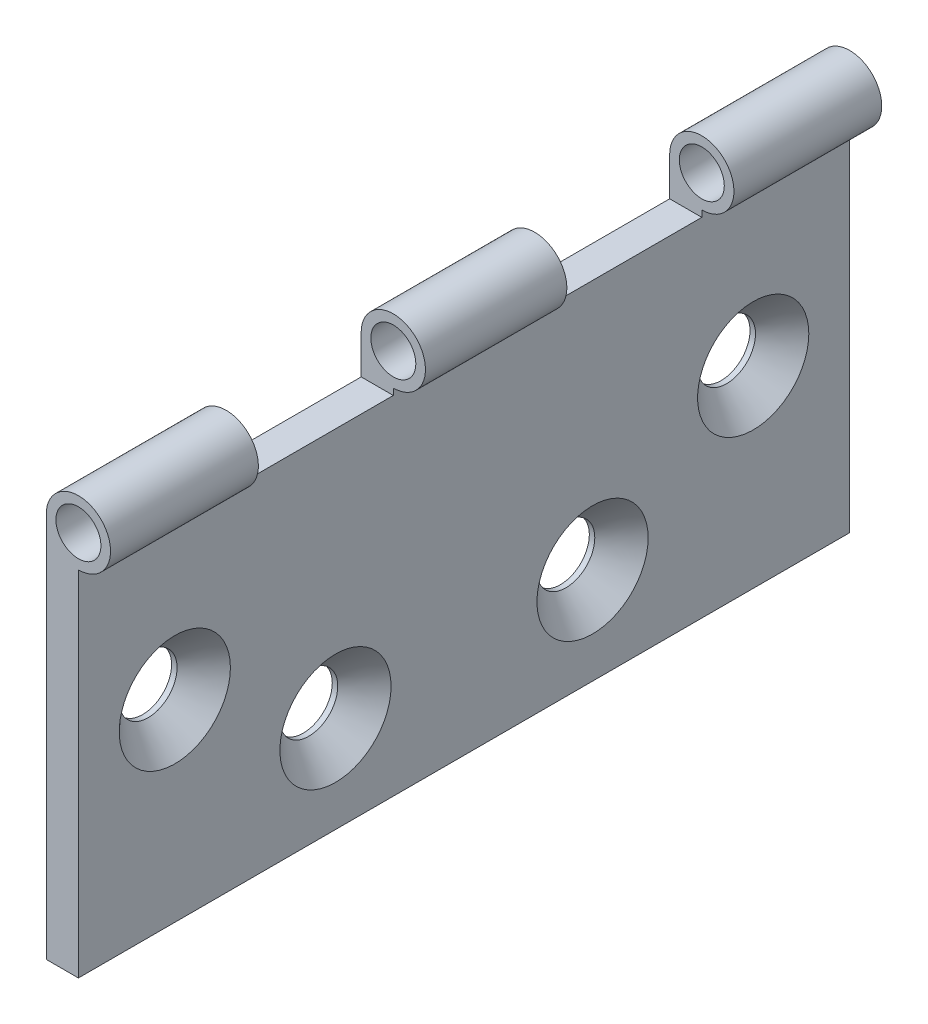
ISO-10303-21;
HEADER;
FILE_DESCRIPTION(('STEP AP214'),'2;1');
FILE_NAME('part.step','',(''),(''),'','','');
FILE_SCHEMA(('AUTOMOTIVE_DESIGN { 1 0 10303 214 1 1 1 1 }'));
ENDSEC;
DATA;
#1=APPLICATION_CONTEXT('core data for automotive mechanical design processes');
#2=APPLICATION_PROTOCOL_DEFINITION('international standard','automotive_design',2000,#1);
#3=PRODUCT_CONTEXT('',#1,'mechanical');
#4=PRODUCT('Part','Part','',(#3));
#5=PRODUCT_RELATED_PRODUCT_CATEGORY('part','',(#4));
#6=PRODUCT_DEFINITION_FORMATION('','',#4);
#7=PRODUCT_DEFINITION_CONTEXT('part definition',#1,'design');
#8=PRODUCT_DEFINITION('design','',#6,#7);
#9=PRODUCT_DEFINITION_SHAPE('','',#8);
#10=(LENGTH_UNIT() NAMED_UNIT(*) SI_UNIT(.MILLI.,.METRE.));
#11=(NAMED_UNIT(*) PLANE_ANGLE_UNIT() SI_UNIT($,.RADIAN.));
#12=(NAMED_UNIT(*) SI_UNIT($,.STERADIAN.) SOLID_ANGLE_UNIT());
#13=UNCERTAINTY_MEASURE_WITH_UNIT(LENGTH_MEASURE(1.E-05),#10,'distance_accuracy_value','');
#14=(GEOMETRIC_REPRESENTATION_CONTEXT(3) GLOBAL_UNCERTAINTY_ASSIGNED_CONTEXT((#13)) GLOBAL_UNIT_ASSIGNED_CONTEXT((#10,
#11,#12)) REPRESENTATION_CONTEXT('',''));
#15=CARTESIAN_POINT('',(0.,0.,0.));
#16=DIRECTION('',(0.,0.,1.));
#17=DIRECTION('',(1.,0.,0.));
#18=AXIS2_PLACEMENT_3D('',#15,#16,#17);
#19=CARTESIAN_POINT('',(5.,60.,-60.));
#20=DIRECTION('',(0.,0.,1.));
#21=DIRECTION('',(1.,0.,0.));
#22=AXIS2_PLACEMENT_3D('',#19,#20,#21);
#23=CYLINDRICAL_SURFACE('',#22,5.);
#24=CARTESIAN_POINT('',(5.,60.,-37.));
#25=DIRECTION('',(0.,0.,-1.));
#26=DIRECTION('',(-1.,0.,0.));
#27=AXIS2_PLACEMENT_3D('',#24,#25,#26);
#28=CIRCLE('',#27,5.);
#29=CARTESIAN_POINT('',(5.,55.,-37.));
#30=VERTEX_POINT('',#29);
#31=CARTESIAN_POINT('',(0.,60.,-37.));
#32=VERTEX_POINT('',#31);
#33=EDGE_CURVE('E251',#30,#32,#28,.F.);
#34=ORIENTED_EDGE('',*,*,#33,.F.);
#35=DIRECTION('',(0.,0.,1.));
#36=VECTOR('',#35,1.);
#37=CARTESIAN_POINT('',(5.,55.,-60.));
#38=LINE('',#37,#36);
#39=CARTESIAN_POINT('',(5.,55.,-60.));
#40=VERTEX_POINT('',#39);
#41=EDGE_CURVE('E89',#40,#30,#38,.T.);
#42=ORIENTED_EDGE('',*,*,#41,.F.);
#43=CARTESIAN_POINT('',(5.,60.,-60.));
#44=DIRECTION('',(0.,0.,1.));
#45=DIRECTION('',(1.,0.,0.));
#46=AXIS2_PLACEMENT_3D('',#43,#44,#45);
#47=CIRCLE('',#46,5.);
#48=CARTESIAN_POINT('',(0.,60.,-60.));
#49=VERTEX_POINT('',#48);
#50=EDGE_CURVE('E87',#40,#49,#47,.T.);
#51=ORIENTED_EDGE('',*,*,#50,.T.);
#52=DIRECTION('',(0.,0.,-1.));
#53=VECTOR('',#52,1.);
#54=CARTESIAN_POINT('',(0.,60.,60.));
#55=LINE('',#54,#53);
#56=EDGE_CURVE('E99',#32,#49,#55,.T.);
#57=ORIENTED_EDGE('',*,*,#56,.F.);
#58=EDGE_LOOP('',(#34,#42,#51,#57));
#59=FACE_BOUND('',#58,.T.);
#60=ADVANCED_FACE('F30',(#59),#23,.T.);
#61=CARTESIAN_POINT('',(5.,60.,-60.));
#62=DIRECTION('',(0.,0.,1.));
#63=DIRECTION('',(1.,0.,0.));
#64=AXIS2_PLACEMENT_3D('',#61,#62,#63);
#65=CYLINDRICAL_SURFACE('',#64,3.5);
#66=CARTESIAN_POINT('',(5.,60.,-37.));
#67=DIRECTION('',(0.,0.,-1.));
#68=DIRECTION('',(-1.,0.,0.));
#69=AXIS2_PLACEMENT_3D('',#66,#67,#68);
#70=CIRCLE('',#69,3.5);
#71=CARTESIAN_POINT('',(1.5,60.,-37.));
#72=VERTEX_POINT('',#71);
#73=EDGE_CURVE('E270',#72,#72,#70,.F.);
#74=ORIENTED_EDGE('',*,*,#73,.T.);
#75=EDGE_LOOP('',(#74));
#76=FACE_BOUND('',#75,.T.);
#77=CARTESIAN_POINT('',(5.,60.,-60.));
#78=DIRECTION('',(0.,0.,1.));
#79=DIRECTION('',(1.,0.,0.));
#80=AXIS2_PLACEMENT_3D('',#77,#78,#79);
#81=CIRCLE('',#80,3.5);
#82=CARTESIAN_POINT('',(8.5,60.,-60.));
#83=VERTEX_POINT('',#82);
#84=EDGE_CURVE('E167',#83,#83,#81,.T.);
#85=ORIENTED_EDGE('',*,*,#84,.F.);
#86=EDGE_LOOP('',(#85));
#87=FACE_BOUND('',#86,.T.);
#88=ADVANCED_FACE('F308',(#76,#87),#65,.F.);
#89=CARTESIAN_POINT('',(5.,60.,-11.));
#90=DIRECTION('',(0.,0.,1.));
#91=DIRECTION('',(0.,-1.,0.));
#92=AXIS2_PLACEMENT_3D('',#89,#90,#91);
#93=CIRCLE('',#92,5.);
#94=CARTESIAN_POINT('',(0.,60.,-11.));
#95=VERTEX_POINT('',#94);
#96=CARTESIAN_POINT('',(5.,55.,-11.));
#97=VERTEX_POINT('',#96);
#98=EDGE_CURVE('E261',#95,#97,#93,.F.);
#99=ORIENTED_EDGE('',*,*,#98,.F.);
#100=CARTESIAN_POINT('',(0.,60.,11.));
#101=VERTEX_POINT('',#100);
#102=EDGE_CURVE('E102',#101,#95,#55,.T.);
#103=ORIENTED_EDGE('',*,*,#102,.F.);
#104=CARTESIAN_POINT('',(5.,60.,11.));
#105=DIRECTION('',(0.,0.,-1.));
#106=DIRECTION('',(0.,1.,0.));
#107=AXIS2_PLACEMENT_3D('',#104,#105,#106);
#108=CIRCLE('',#107,5.);
#109=CARTESIAN_POINT('',(5.,55.,11.));
#110=VERTEX_POINT('',#109);
#111=EDGE_CURVE('E109',#110,#101,#108,.F.);
#112=ORIENTED_EDGE('',*,*,#111,.F.);
#113=EDGE_CURVE('E177',#97,#110,#38,.T.);
#114=ORIENTED_EDGE('',*,*,#113,.F.);
#115=EDGE_LOOP('',(#99,#103,#112,#114));
#116=FACE_BOUND('',#115,.T.);
#117=ADVANCED_FACE('F300',(#116),#23,.T.);
#118=CARTESIAN_POINT('',(5.,60.,-11.));
#119=DIRECTION('',(0.,0.,1.));
#120=DIRECTION('',(0.,-1.,0.));
#121=AXIS2_PLACEMENT_3D('',#118,#119,#120);
#122=CIRCLE('',#121,3.5);
#123=CARTESIAN_POINT('',(5.,56.5,-11.));
#124=VERTEX_POINT('',#123);
#125=EDGE_CURVE('E263',#124,#124,#122,.F.);
#126=ORIENTED_EDGE('',*,*,#125,.T.);
#127=EDGE_LOOP('',(#126));
#128=FACE_BOUND('',#127,.T.);
#129=CARTESIAN_POINT('',(5.,60.,11.));
#130=DIRECTION('',(0.,0.,-1.));
#131=DIRECTION('',(0.,1.,0.));
#132=AXIS2_PLACEMENT_3D('',#129,#130,#131);
#133=CIRCLE('',#132,3.5);
#134=CARTESIAN_POINT('',(5.,63.5,11.));
#135=VERTEX_POINT('',#134);
#136=EDGE_CURVE('E107',#135,#135,#133,.F.);
#137=ORIENTED_EDGE('',*,*,#136,.T.);
#138=EDGE_LOOP('',(#137));
#139=FACE_BOUND('',#138,.T.);
#140=ADVANCED_FACE('F309',(#128,#139),#65,.F.);
#141=CARTESIAN_POINT('',(5.,0.,60.));
#142=DIRECTION('',(-1.,0.,0.));
#143=DIRECTION('',(0.,0.,1.));
#144=AXIS2_PLACEMENT_3D('',#141,#142,#143);
#145=PLANE('',#144);
#146=CARTESIAN_POINT('',(5.,30.,-45.));
#147=DIRECTION('',(1.,0.,0.));
#148=DIRECTION('',(0.,0.,-1.));
#149=AXIS2_PLACEMENT_3D('',#146,#147,#148);
#150=CIRCLE('',#149,8.65);
#151=CARTESIAN_POINT('',(5.,30.,-53.65));
#152=VERTEX_POINT('',#151);
#153=EDGE_CURVE('E130',#152,#152,#150,.T.);
#154=ORIENTED_EDGE('',*,*,#153,.F.);
#155=EDGE_LOOP('',(#154));
#156=FACE_BOUND('',#155,.T.);
#157=CARTESIAN_POINT('',(5.,15.,-20.));
#158=DIRECTION('',(1.,0.,0.));
#159=DIRECTION('',(0.,0.,-1.));
#160=AXIS2_PLACEMENT_3D('',#157,#158,#159);
#161=CIRCLE('',#160,8.65);
#162=CARTESIAN_POINT('',(5.,15.,-28.65));
#163=VERTEX_POINT('',#162);
#164=EDGE_CURVE('E139',#163,#163,#161,.T.);
#165=ORIENTED_EDGE('',*,*,#164,.F.);
#166=EDGE_LOOP('',(#165));
#167=FACE_BOUND('',#166,.T.);
#168=CARTESIAN_POINT('',(5.,30.,45.));
#169=DIRECTION('',(1.,0.,0.));
#170=DIRECTION('',(0.,0.,-1.));
#171=AXIS2_PLACEMENT_3D('',#168,#169,#170);
#172=CIRCLE('',#171,8.65);
#173=CARTESIAN_POINT('',(5.,30.,36.35));
#174=VERTEX_POINT('',#173);
#175=EDGE_CURVE('E148',#174,#174,#172,.T.);
#176=ORIENTED_EDGE('',*,*,#175,.F.);
#177=EDGE_LOOP('',(#176));
#178=FACE_BOUND('',#177,.T.);
#179=CARTESIAN_POINT('',(5.,15.,20.));
#180=DIRECTION('',(1.,0.,0.));
#181=DIRECTION('',(0.,0.,-1.));
#182=AXIS2_PLACEMENT_3D('',#179,#180,#181);
#183=CIRCLE('',#182,8.65);
#184=CARTESIAN_POINT('',(5.,15.,11.35));
#185=VERTEX_POINT('',#184);
#186=EDGE_CURVE('E157',#185,#185,#183,.T.);
#187=ORIENTED_EDGE('',*,*,#186,.F.);
#188=EDGE_LOOP('',(#187));
#189=FACE_BOUND('',#188,.T.);
#190=ORIENTED_EDGE('',*,*,#41,.T.);
#191=DIRECTION('',(0.,-1.,0.));
#192=VECTOR('',#191,1.);
#193=CARTESIAN_POINT('',(5.,0.,-37.));
#194=LINE('',#193,#192);
#195=CARTESIAN_POINT('',(5.,54.,-37.));
#196=VERTEX_POINT('',#195);
#197=EDGE_CURVE('E267',#30,#196,#194,.T.);
#198=ORIENTED_EDGE('',*,*,#197,.T.);
#199=DIRECTION('',(0.,0.,1.));
#200=VECTOR('',#199,1.);
#201=CARTESIAN_POINT('',(5.,54.,60.));
#202=LINE('',#201,#200);
#203=CARTESIAN_POINT('',(5.,54.,-11.));
#204=VERTEX_POINT('',#203);
#205=EDGE_CURVE('E241',#196,#204,#202,.T.);
#206=ORIENTED_EDGE('',*,*,#205,.T.);
#207=DIRECTION('',(0.,1.,0.));
#208=VECTOR('',#207,1.);
#209=CARTESIAN_POINT('',(5.,0.,-11.));
#210=LINE('',#209,#208);
#211=EDGE_CURVE('E245',#204,#97,#210,.T.);
#212=ORIENTED_EDGE('',*,*,#211,.T.);
#213=ORIENTED_EDGE('',*,*,#113,.T.);
#214=DIRECTION('',(0.,-1.,0.));
#215=VECTOR('',#214,1.);
#216=CARTESIAN_POINT('',(5.,0.,11.));
#217=LINE('',#216,#215);
#218=CARTESIAN_POINT('',(5.,54.,11.));
#219=VERTEX_POINT('',#218);
#220=EDGE_CURVE('E114',#110,#219,#217,.T.);
#221=ORIENTED_EDGE('',*,*,#220,.T.);
#222=DIRECTION('',(0.,0.,1.));
#223=VECTOR('',#222,1.);
#224=CARTESIAN_POINT('',(5.,54.,60.));
#225=LINE('',#224,#223);
#226=CARTESIAN_POINT('',(5.,54.,37.));
#227=VERTEX_POINT('',#226);
#228=EDGE_CURVE('E128',#219,#227,#225,.T.);
#229=ORIENTED_EDGE('',*,*,#228,.T.);
#230=DIRECTION('',(0.,1.,0.));
#231=VECTOR('',#230,1.);
#232=CARTESIAN_POINT('',(5.,0.,37.));
#233=LINE('',#232,#231);
#234=CARTESIAN_POINT('',(5.,55.,37.));
#235=VERTEX_POINT('',#234);
#236=EDGE_CURVE('E110',#227,#235,#233,.T.);
#237=ORIENTED_EDGE('',*,*,#236,.T.);
#238=CARTESIAN_POINT('',(5.,55.,60.));
#239=VERTEX_POINT('',#238);
#240=EDGE_CURVE('E174',#235,#239,#38,.T.);
#241=ORIENTED_EDGE('',*,*,#240,.T.);
#242=DIRECTION('',(0.,1.,0.));
#243=VECTOR('',#242,1.);
#244=CARTESIAN_POINT('',(5.,0.,60.));
#245=LINE('',#244,#243);
#246=CARTESIAN_POINT('',(5.,0.,60.));
#247=VERTEX_POINT('',#246);
#248=EDGE_CURVE('E75',#247,#239,#245,.T.);
#249=ORIENTED_EDGE('',*,*,#248,.F.);
#250=DIRECTION('',(0.,0.,-1.));
#251=VECTOR('',#250,1.);
#252=CARTESIAN_POINT('',(5.,0.,60.));
#253=LINE('',#252,#251);
#254=CARTESIAN_POINT('',(5.,0.,-60.));
#255=VERTEX_POINT('',#254);
#256=EDGE_CURVE('E54',#247,#255,#253,.T.);
#257=ORIENTED_EDGE('',*,*,#256,.T.);
#258=DIRECTION('',(0.,1.,0.));
#259=VECTOR('',#258,1.);
#260=CARTESIAN_POINT('',(5.,0.,-60.));
#261=LINE('',#260,#259);
#262=EDGE_CURVE('E72',#255,#40,#261,.T.);
#263=ORIENTED_EDGE('',*,*,#262,.T.);
#264=EDGE_LOOP('',(#190,#198,#206,#212,#213,#221,#229,#237,#241,#249,#257,#263));
#265=FACE_BOUND('',#264,.T.);
#266=ADVANCED_FACE('F32',(#156,#167,#178,#189,#265),#145,.F.);
#267=CARTESIAN_POINT('',(0.,0.,60.));
#268=DIRECTION('',(-1.,0.,0.));
#269=DIRECTION('',(0.,0.,1.));
#270=AXIS2_PLACEMENT_3D('',#267,#268,#269);
#271=PLANE('',#270);
#272=DIRECTION('',(0.,1.,0.));
#273=VECTOR('',#272,1.);
#274=CARTESIAN_POINT('',(0.,65.,-37.));
#275=LINE('',#274,#273);
#276=CARTESIAN_POINT('',(0.,54.,-37.));
#277=VERTEX_POINT('',#276);
#278=EDGE_CURVE('E248',#277,#32,#275,.T.);
#279=ORIENTED_EDGE('',*,*,#278,.T.);
#280=ORIENTED_EDGE('',*,*,#56,.T.);
#281=DIRECTION('',(0.,1.,0.));
#282=VECTOR('',#281,1.);
#283=CARTESIAN_POINT('',(0.,0.,-60.));
#284=LINE('',#283,#282);
#285=CARTESIAN_POINT('',(0.,0.,-60.));
#286=VERTEX_POINT('',#285);
#287=EDGE_CURVE('E88',#286,#49,#284,.T.);
#288=ORIENTED_EDGE('',*,*,#287,.F.);
#289=DIRECTION('',(0.,0.,-1.));
#290=VECTOR('',#289,1.);
#291=CARTESIAN_POINT('',(0.,0.,60.));
#292=LINE('',#291,#290);
#293=CARTESIAN_POINT('',(0.,0.,60.));
#294=VERTEX_POINT('',#293);
#295=EDGE_CURVE('E77',#294,#286,#292,.T.);
#296=ORIENTED_EDGE('',*,*,#295,.F.);
#297=DIRECTION('',(0.,1.,0.));
#298=VECTOR('',#297,1.);
#299=CARTESIAN_POINT('',(0.,0.,60.));
#300=LINE('',#299,#298);
#301=CARTESIAN_POINT('',(0.,60.,60.));
#302=VERTEX_POINT('',#301);
#303=EDGE_CURVE('E94',#294,#302,#300,.T.);
#304=ORIENTED_EDGE('',*,*,#303,.T.);
#305=CARTESIAN_POINT('',(0.,60.,37.));
#306=VERTEX_POINT('',#305);
#307=EDGE_CURVE('E38',#302,#306,#55,.T.);
#308=ORIENTED_EDGE('',*,*,#307,.T.);
#309=DIRECTION('',(0.,-1.,0.));
#310=VECTOR('',#309,1.);
#311=CARTESIAN_POINT('',(0.,65.,37.));
#312=LINE('',#311,#310);
#313=CARTESIAN_POINT('',(0.,54.,37.));
#314=VERTEX_POINT('',#313);
#315=EDGE_CURVE('E273',#306,#314,#312,.T.);
#316=ORIENTED_EDGE('',*,*,#315,.T.);
#317=DIRECTION('',(0.,0.,-1.));
#318=VECTOR('',#317,1.);
#319=CARTESIAN_POINT('',(0.,54.,37.));
#320=LINE('',#319,#318);
#321=CARTESIAN_POINT('',(0.,54.,11.));
#322=VERTEX_POINT('',#321);
#323=EDGE_CURVE('E275',#314,#322,#320,.T.);
#324=ORIENTED_EDGE('',*,*,#323,.T.);
#325=DIRECTION('',(0.,1.,0.));
#326=VECTOR('',#325,1.);
#327=CARTESIAN_POINT('',(0.,65.,11.));
#328=LINE('',#327,#326);
#329=EDGE_CURVE('E278',#322,#101,#328,.T.);
#330=ORIENTED_EDGE('',*,*,#329,.T.);
#331=ORIENTED_EDGE('',*,*,#102,.T.);
#332=DIRECTION('',(0.,1.,0.));
#333=VECTOR('',#332,1.);
#334=CARTESIAN_POINT('',(0.,0.,-11.));
#335=LINE('',#334,#333);
#336=CARTESIAN_POINT('',(0.,54.,-11.));
#337=VERTEX_POINT('',#336);
#338=EDGE_CURVE('E11',#337,#95,#335,.T.);
#339=ORIENTED_EDGE('',*,*,#338,.F.);
#340=DIRECTION('',(0.,0.,-1.));
#341=VECTOR('',#340,1.);
#342=CARTESIAN_POINT('',(0.,54.,-11.));
#343=LINE('',#342,#341);
#344=EDGE_CURVE('E45',#337,#277,#343,.T.);
#345=ORIENTED_EDGE('',*,*,#344,.T.);
#346=EDGE_LOOP('',(#279,#280,#288,#296,#304,#308,#316,#324,#330,#331,#339,#345));
#347=FACE_BOUND('',#346,.T.);
#348=CARTESIAN_POINT('',(0.,30.,-45.));
#349=DIRECTION('',(1.,0.,0.));
#350=DIRECTION('',(0.,0.,-1.));
#351=AXIS2_PLACEMENT_3D('',#348,#349,#350);
#352=CIRCLE('',#351,4.5);
#353=CARTESIAN_POINT('',(0.,30.,-49.5));
#354=VERTEX_POINT('',#353);
#355=EDGE_CURVE('E136',#354,#354,#352,.T.);
#356=ORIENTED_EDGE('',*,*,#355,.T.);
#357=EDGE_LOOP('',(#356));
#358=FACE_BOUND('',#357,.T.);
#359=CARTESIAN_POINT('',(0.,15.,-20.));
#360=DIRECTION('',(1.,0.,0.));
#361=DIRECTION('',(0.,0.,-1.));
#362=AXIS2_PLACEMENT_3D('',#359,#360,#361);
#363=CIRCLE('',#362,4.5);
#364=CARTESIAN_POINT('',(0.,15.,-24.5));
#365=VERTEX_POINT('',#364);
#366=EDGE_CURVE('E145',#365,#365,#363,.T.);
#367=ORIENTED_EDGE('',*,*,#366,.T.);
#368=EDGE_LOOP('',(#367));
#369=FACE_BOUND('',#368,.T.);
#370=CARTESIAN_POINT('',(0.,30.,45.));
#371=DIRECTION('',(1.,0.,0.));
#372=DIRECTION('',(0.,0.,-1.));
#373=AXIS2_PLACEMENT_3D('',#370,#371,#372);
#374=CIRCLE('',#373,4.5);
#375=CARTESIAN_POINT('',(0.,30.,40.5));
#376=VERTEX_POINT('',#375);
#377=EDGE_CURVE('E154',#376,#376,#374,.T.);
#378=ORIENTED_EDGE('',*,*,#377,.T.);
#379=EDGE_LOOP('',(#378));
#380=FACE_BOUND('',#379,.T.);
#381=CARTESIAN_POINT('',(0.,15.,20.));
#382=DIRECTION('',(1.,0.,0.));
#383=DIRECTION('',(0.,0.,-1.));
#384=AXIS2_PLACEMENT_3D('',#381,#382,#383);
#385=CIRCLE('',#384,4.5);
#386=CARTESIAN_POINT('',(0.,15.,15.5));
#387=VERTEX_POINT('',#386);
#388=EDGE_CURVE('E163',#387,#387,#385,.T.);
#389=ORIENTED_EDGE('',*,*,#388,.T.);
#390=EDGE_LOOP('',(#389));
#391=FACE_BOUND('',#390,.T.);
#392=ADVANCED_FACE('F188',(#347,#358,#369,#380,#391),#271,.T.);
#393=CARTESIAN_POINT('',(5.,0.,60.));
#394=DIRECTION('',(0.,-1.,0.));
#395=DIRECTION('',(0.,0.,-1.));
#396=AXIS2_PLACEMENT_3D('',#393,#394,#395);
#397=PLANE('',#396);
#398=DIRECTION('',(-1.,0.,0.));
#399=VECTOR('',#398,1.);
#400=CARTESIAN_POINT('',(5.,0.,-60.));
#401=LINE('',#400,#399);
#402=EDGE_CURVE('E85',#255,#286,#401,.T.);
#403=ORIENTED_EDGE('',*,*,#402,.F.);
#404=ORIENTED_EDGE('',*,*,#256,.F.);
#405=DIRECTION('',(-1.,0.,0.));
#406=VECTOR('',#405,1.);
#407=CARTESIAN_POINT('',(5.,0.,60.));
#408=LINE('',#407,#406);
#409=EDGE_CURVE('E78',#247,#294,#408,.T.);
#410=ORIENTED_EDGE('',*,*,#409,.T.);
#411=ORIENTED_EDGE('',*,*,#295,.T.);
#412=EDGE_LOOP('',(#403,#404,#410,#411));
#413=FACE_BOUND('',#412,.T.);
#414=ADVANCED_FACE('F91',(#413),#397,.T.);
#415=CARTESIAN_POINT('',(5.,60.,60.));
#416=DIRECTION('',(0.,0.,-1.));
#417=DIRECTION('',(-1.,0.,0.));
#418=AXIS2_PLACEMENT_3D('',#415,#416,#417);
#419=PLANE('',#418);
#420=CARTESIAN_POINT('',(5.,60.,60.));
#421=DIRECTION('',(0.,0.,1.));
#422=DIRECTION('',(1.,0.,0.));
#423=AXIS2_PLACEMENT_3D('',#420,#421,#422);
#424=CIRCLE('',#423,3.5);
#425=CARTESIAN_POINT('',(8.5,60.,60.));
#426=VERTEX_POINT('',#425);
#427=EDGE_CURVE('E166',#426,#426,#424,.T.);
#428=ORIENTED_EDGE('',*,*,#427,.F.);
#429=EDGE_LOOP('',(#428));
#430=FACE_BOUND('',#429,.T.);
#431=ORIENTED_EDGE('',*,*,#248,.T.);
#432=CARTESIAN_POINT('',(5.,60.,60.));
#433=DIRECTION('',(0.,0.,1.));
#434=DIRECTION('',(1.,0.,0.));
#435=AXIS2_PLACEMENT_3D('',#432,#433,#434);
#436=CIRCLE('',#435,5.);
#437=EDGE_CURVE('E170',#239,#302,#436,.T.);
#438=ORIENTED_EDGE('',*,*,#437,.T.);
#439=ORIENTED_EDGE('',*,*,#303,.F.);
#440=ORIENTED_EDGE('',*,*,#409,.F.);
#441=EDGE_LOOP('',(#431,#438,#439,#440));
#442=FACE_BOUND('',#441,.T.);
#443=ADVANCED_FACE('F183',(#430,#442),#419,.F.);
#444=CARTESIAN_POINT('',(5.,60.,-60.));
#445=DIRECTION('',(0.,0.,-1.));
#446=DIRECTION('',(-1.,0.,0.));
#447=AXIS2_PLACEMENT_3D('',#444,#445,#446);
#448=PLANE('',#447);
#449=ORIENTED_EDGE('',*,*,#84,.T.);
#450=EDGE_LOOP('',(#449));
#451=FACE_BOUND('',#450,.T.);
#452=ORIENTED_EDGE('',*,*,#287,.T.);
#453=ORIENTED_EDGE('',*,*,#50,.F.);
#454=ORIENTED_EDGE('',*,*,#262,.F.);
#455=ORIENTED_EDGE('',*,*,#402,.T.);
#456=EDGE_LOOP('',(#452,#453,#454,#455));
#457=FACE_BOUND('',#456,.T.);
#458=ADVANCED_FACE('F84',(#451,#457),#448,.T.);
#459=ORIENTED_EDGE('',*,*,#240,.F.);
#460=CARTESIAN_POINT('',(5.,60.,37.));
#461=DIRECTION('',(0.,0.,1.));
#462=DIRECTION('',(1.,0.,0.));
#463=AXIS2_PLACEMENT_3D('',#460,#461,#462);
#464=CIRCLE('',#463,5.);
#465=EDGE_CURVE('E105',#306,#235,#464,.F.);
#466=ORIENTED_EDGE('',*,*,#465,.F.);
#467=ORIENTED_EDGE('',*,*,#307,.F.);
#468=ORIENTED_EDGE('',*,*,#437,.F.);
#469=EDGE_LOOP('',(#459,#466,#467,#468));
#470=FACE_BOUND('',#469,.T.);
#471=ADVANCED_FACE('F296',(#470),#23,.T.);
#472=CARTESIAN_POINT('',(5.,60.,37.));
#473=DIRECTION('',(0.,0.,1.));
#474=DIRECTION('',(1.,0.,0.));
#475=AXIS2_PLACEMENT_3D('',#472,#473,#474);
#476=CIRCLE('',#475,3.5);
#477=CARTESIAN_POINT('',(8.5,60.,37.));
#478=VERTEX_POINT('',#477);
#479=EDGE_CURVE('E103',#478,#478,#476,.F.);
#480=ORIENTED_EDGE('',*,*,#479,.T.);
#481=EDGE_LOOP('',(#480));
#482=FACE_BOUND('',#481,.T.);
#483=ORIENTED_EDGE('',*,*,#427,.T.);
#484=EDGE_LOOP('',(#483));
#485=FACE_BOUND('',#484,.T.);
#486=ADVANCED_FACE('F298',(#482,#485),#65,.F.);
#487=CARTESIAN_POINT('',(5.,15.,20.));
#488=DIRECTION('',(1.,0.,0.));
#489=DIRECTION('',(0.,0.,-1.));
#490=AXIS2_PLACEMENT_3D('',#487,#488,#489);
#491=CYLINDRICAL_SURFACE('',#490,4.5);
#492=ORIENTED_EDGE('',*,*,#388,.F.);
#493=EDGE_LOOP('',(#492));
#494=FACE_BOUND('',#493,.T.);
#495=CARTESIAN_POINT('',(0.850000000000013,15.,20.));
#496=DIRECTION('',(1.,0.,0.));
#497=DIRECTION('',(0.,0.,-1.));
#498=AXIS2_PLACEMENT_3D('',#495,#496,#497);
#499=CIRCLE('',#498,4.49999999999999);
#500=CARTESIAN_POINT('',(0.850000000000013,15.,15.5));
#501=VERTEX_POINT('',#500);
#502=EDGE_CURVE('E160',#501,#501,#499,.T.);
#503=ORIENTED_EDGE('',*,*,#502,.T.);
#504=EDGE_LOOP('',(#503));
#505=FACE_BOUND('',#504,.T.);
#506=ADVANCED_FACE('F305',(#494,#505),#491,.F.);
#507=CARTESIAN_POINT('',(5.,15.,20.));
#508=DIRECTION('',(1.,0.,0.));
#509=DIRECTION('',(0.,0.,-1.));
#510=AXIS2_PLACEMENT_3D('',#507,#508,#509);
#511=CONICAL_SURFACE('',#510,8.65,0.785398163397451);
#512=ORIENTED_EDGE('',*,*,#502,.F.);
#513=EDGE_LOOP('',(#512));
#514=FACE_BOUND('',#513,.T.);
#515=ORIENTED_EDGE('',*,*,#186,.T.);
#516=EDGE_LOOP('',(#515));
#517=FACE_BOUND('',#516,.T.);
#518=ADVANCED_FACE('F368',(#514,#517),#511,.F.);
#519=CARTESIAN_POINT('',(5.,30.,45.));
#520=DIRECTION('',(1.,0.,0.));
#521=DIRECTION('',(0.,0.,-1.));
#522=AXIS2_PLACEMENT_3D('',#519,#520,#521);
#523=CYLINDRICAL_SURFACE('',#522,4.49999999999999);
#524=ORIENTED_EDGE('',*,*,#377,.F.);
#525=EDGE_LOOP('',(#524));
#526=FACE_BOUND('',#525,.T.);
#527=CARTESIAN_POINT('',(0.850000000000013,30.,45.));
#528=DIRECTION('',(1.,0.,0.));
#529=DIRECTION('',(0.,0.,-1.));
#530=AXIS2_PLACEMENT_3D('',#527,#528,#529);
#531=CIRCLE('',#530,4.49999999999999);
#532=CARTESIAN_POINT('',(0.850000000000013,30.,40.5));
#533=VERTEX_POINT('',#532);
#534=EDGE_CURVE('E151',#533,#533,#531,.T.);
#535=ORIENTED_EDGE('',*,*,#534,.T.);
#536=EDGE_LOOP('',(#535));
#537=FACE_BOUND('',#536,.T.);
#538=ADVANCED_FACE('F364',(#526,#537),#523,.F.);
#539=CARTESIAN_POINT('',(5.,30.,45.));
#540=DIRECTION('',(1.,0.,0.));
#541=DIRECTION('',(0.,0.,-1.));
#542=AXIS2_PLACEMENT_3D('',#539,#540,#541);
#543=CONICAL_SURFACE('',#542,8.65,0.785398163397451);
#544=ORIENTED_EDGE('',*,*,#534,.F.);
#545=EDGE_LOOP('',(#544));
#546=FACE_BOUND('',#545,.T.);
#547=ORIENTED_EDGE('',*,*,#175,.T.);
#548=EDGE_LOOP('',(#547));
#549=FACE_BOUND('',#548,.T.);
#550=ADVANCED_FACE('F360',(#546,#549),#543,.F.);
#551=CARTESIAN_POINT('',(5.,15.,-20.));
#552=DIRECTION('',(1.,0.,0.));
#553=DIRECTION('',(0.,0.,-1.));
#554=AXIS2_PLACEMENT_3D('',#551,#552,#553);
#555=CYLINDRICAL_SURFACE('',#554,4.5);
#556=ORIENTED_EDGE('',*,*,#366,.F.);
#557=EDGE_LOOP('',(#556));
#558=FACE_BOUND('',#557,.T.);
#559=CARTESIAN_POINT('',(0.850000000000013,15.,-20.));
#560=DIRECTION('',(1.,0.,0.));
#561=DIRECTION('',(0.,0.,-1.));
#562=AXIS2_PLACEMENT_3D('',#559,#560,#561);
#563=CIRCLE('',#562,4.49999999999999);
#564=CARTESIAN_POINT('',(0.850000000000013,15.,-24.5));
#565=VERTEX_POINT('',#564);
#566=EDGE_CURVE('E142',#565,#565,#563,.T.);
#567=ORIENTED_EDGE('',*,*,#566,.T.);
#568=EDGE_LOOP('',(#567));
#569=FACE_BOUND('',#568,.T.);
#570=ADVANCED_FACE('F356',(#558,#569),#555,.F.);
#571=CARTESIAN_POINT('',(5.,15.,-20.));
#572=DIRECTION('',(1.,0.,0.));
#573=DIRECTION('',(0.,0.,-1.));
#574=AXIS2_PLACEMENT_3D('',#571,#572,#573);
#575=CONICAL_SURFACE('',#574,8.65,0.785398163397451);
#576=ORIENTED_EDGE('',*,*,#566,.F.);
#577=EDGE_LOOP('',(#576));
#578=FACE_BOUND('',#577,.T.);
#579=ORIENTED_EDGE('',*,*,#164,.T.);
#580=EDGE_LOOP('',(#579));
#581=FACE_BOUND('',#580,.T.);
#582=ADVANCED_FACE('F352',(#578,#581),#575,.F.);
#583=CARTESIAN_POINT('',(5.,30.,-45.));
#584=DIRECTION('',(1.,0.,0.));
#585=DIRECTION('',(0.,0.,-1.));
#586=AXIS2_PLACEMENT_3D('',#583,#584,#585);
#587=CYLINDRICAL_SURFACE('',#586,4.49999999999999);
#588=ORIENTED_EDGE('',*,*,#355,.F.);
#589=EDGE_LOOP('',(#588));
#590=FACE_BOUND('',#589,.T.);
#591=CARTESIAN_POINT('',(0.850000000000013,30.,-45.));
#592=DIRECTION('',(1.,0.,0.));
#593=DIRECTION('',(0.,0.,-1.));
#594=AXIS2_PLACEMENT_3D('',#591,#592,#593);
#595=CIRCLE('',#594,4.49999999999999);
#596=CARTESIAN_POINT('',(0.850000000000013,30.,-49.5));
#597=VERTEX_POINT('',#596);
#598=EDGE_CURVE('E133',#597,#597,#595,.T.);
#599=ORIENTED_EDGE('',*,*,#598,.T.);
#600=EDGE_LOOP('',(#599));
#601=FACE_BOUND('',#600,.T.);
#602=ADVANCED_FACE('F348',(#590,#601),#587,.F.);
#603=CARTESIAN_POINT('',(5.,30.,-45.));
#604=DIRECTION('',(1.,0.,0.));
#605=DIRECTION('',(0.,0.,-1.));
#606=AXIS2_PLACEMENT_3D('',#603,#604,#605);
#607=CONICAL_SURFACE('',#606,8.65,0.785398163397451);
#608=ORIENTED_EDGE('',*,*,#598,.F.);
#609=EDGE_LOOP('',(#608));
#610=FACE_BOUND('',#609,.T.);
#611=ORIENTED_EDGE('',*,*,#153,.T.);
#612=EDGE_LOOP('',(#611));
#613=FACE_BOUND('',#612,.T.);
#614=ADVANCED_FACE('F342',(#610,#613),#607,.F.);
#615=CARTESIAN_POINT('',(0.,54.,37.));
#616=DIRECTION('',(0.,-1.,0.));
#617=DIRECTION('',(0.,0.,-1.));
#618=AXIS2_PLACEMENT_3D('',#615,#616,#617);
#619=PLANE('',#618);
#620=DIRECTION('',(1.,0.,0.));
#621=VECTOR('',#620,1.);
#622=CARTESIAN_POINT('',(0.,54.,11.));
#623=LINE('',#622,#621);
#624=EDGE_CURVE('E106',#322,#219,#623,.T.);
#625=ORIENTED_EDGE('',*,*,#624,.F.);
#626=ORIENTED_EDGE('',*,*,#323,.F.);
#627=DIRECTION('',(1.,0.,0.));
#628=VECTOR('',#627,1.);
#629=CARTESIAN_POINT('',(0.,54.,37.));
#630=LINE('',#629,#628);
#631=EDGE_CURVE('E281',#314,#227,#630,.T.);
#632=ORIENTED_EDGE('',*,*,#631,.T.);
#633=ORIENTED_EDGE('',*,*,#228,.F.);
#634=EDGE_LOOP('',(#625,#626,#632,#633));
#635=FACE_BOUND('',#634,.T.);
#636=ADVANCED_FACE('F286',(#635),#619,.F.);
#637=CARTESIAN_POINT('',(0.,65.,11.));
#638=DIRECTION('',(0.,0.,-1.));
#639=DIRECTION('',(0.,1.,0.));
#640=AXIS2_PLACEMENT_3D('',#637,#638,#639);
#641=PLANE('',#640);
#642=ORIENTED_EDGE('',*,*,#136,.F.);
#643=EDGE_LOOP('',(#642));
#644=FACE_BOUND('',#643,.T.);
#645=ORIENTED_EDGE('',*,*,#220,.F.);
#646=ORIENTED_EDGE('',*,*,#111,.T.);
#647=ORIENTED_EDGE('',*,*,#329,.F.);
#648=ORIENTED_EDGE('',*,*,#624,.T.);
#649=EDGE_LOOP('',(#645,#646,#647,#648));
#650=FACE_BOUND('',#649,.T.);
#651=ADVANCED_FACE('F292',(#644,#650),#641,.F.);
#652=CARTESIAN_POINT('',(0.,65.,37.));
#653=DIRECTION('',(0.,0.,1.));
#654=DIRECTION('',(1.,0.,0.));
#655=AXIS2_PLACEMENT_3D('',#652,#653,#654);
#656=PLANE('',#655);
#657=ORIENTED_EDGE('',*,*,#479,.F.);
#658=EDGE_LOOP('',(#657));
#659=FACE_BOUND('',#658,.T.);
#660=ORIENTED_EDGE('',*,*,#631,.F.);
#661=ORIENTED_EDGE('',*,*,#315,.F.);
#662=ORIENTED_EDGE('',*,*,#465,.T.);
#663=ORIENTED_EDGE('',*,*,#236,.F.);
#664=EDGE_LOOP('',(#660,#661,#662,#663));
#665=FACE_BOUND('',#664,.T.);
#666=ADVANCED_FACE('F295',(#659,#665),#656,.F.);
#667=CARTESIAN_POINT('',(0.,65.,-37.));
#668=DIRECTION('',(0.,0.,-1.));
#669=DIRECTION('',(-1.,0.,0.));
#670=AXIS2_PLACEMENT_3D('',#667,#668,#669);
#671=PLANE('',#670);
#672=ORIENTED_EDGE('',*,*,#33,.T.);
#673=ORIENTED_EDGE('',*,*,#278,.F.);
#674=DIRECTION('',(1.,0.,0.));
#675=VECTOR('',#674,1.);
#676=CARTESIAN_POINT('',(0.,54.,-37.));
#677=LINE('',#676,#675);
#678=EDGE_CURVE('E237',#277,#196,#677,.T.);
#679=ORIENTED_EDGE('',*,*,#678,.T.);
#680=ORIENTED_EDGE('',*,*,#197,.F.);
#681=EDGE_LOOP('',(#672,#673,#679,#680));
#682=FACE_BOUND('',#681,.T.);
#683=ORIENTED_EDGE('',*,*,#73,.F.);
#684=EDGE_LOOP('',(#683));
#685=FACE_BOUND('',#684,.T.);
#686=ADVANCED_FACE('F249',(#682,#685),#671,.F.);
#687=CARTESIAN_POINT('',(0.,54.,-11.));
#688=DIRECTION('',(0.,-1.,0.));
#689=DIRECTION('',(0.,0.,-1.));
#690=AXIS2_PLACEMENT_3D('',#687,#688,#689);
#691=PLANE('',#690);
#692=ORIENTED_EDGE('',*,*,#678,.F.);
#693=ORIENTED_EDGE('',*,*,#344,.F.);
#694=DIRECTION('',(1.,0.,0.));
#695=VECTOR('',#694,1.);
#696=CARTESIAN_POINT('',(0.,54.,-11.));
#697=LINE('',#696,#695);
#698=EDGE_CURVE('E246',#337,#204,#697,.T.);
#699=ORIENTED_EDGE('',*,*,#698,.T.);
#700=ORIENTED_EDGE('',*,*,#205,.F.);
#701=EDGE_LOOP('',(#692,#693,#699,#700));
#702=FACE_BOUND('',#701,.T.);
#703=ADVANCED_FACE('F239',(#702),#691,.F.);
#704=CARTESIAN_POINT('',(0.,65.,-11.));
#705=DIRECTION('',(0.,0.,1.));
#706=DIRECTION('',(0.,-1.,0.));
#707=AXIS2_PLACEMENT_3D('',#704,#705,#706);
#708=PLANE('',#707);
#709=ORIENTED_EDGE('',*,*,#98,.T.);
#710=ORIENTED_EDGE('',*,*,#211,.F.);
#711=ORIENTED_EDGE('',*,*,#698,.F.);
#712=ORIENTED_EDGE('',*,*,#338,.T.);
#713=EDGE_LOOP('',(#709,#710,#711,#712));
#714=FACE_BOUND('',#713,.T.);
#715=ORIENTED_EDGE('',*,*,#125,.F.);
#716=EDGE_LOOP('',(#715));
#717=FACE_BOUND('',#716,.T.);
#718=ADVANCED_FACE('F325',(#714,#717),#708,.F.);
#719=CLOSED_SHELL('',(#60,#88,#117,#140,#266,#392,#414,#443,#458,#471,#486,#506,#518,#538,#550,
#570,#582,#602,#614,#636,#651,#666,#686,#703,#718));
#720=MANIFOLD_SOLID_BREP('B2',#719);
#721=ADVANCED_BREP_SHAPE_REPRESENTATION('',(#18,#720),#14);
#722=SHAPE_DEFINITION_REPRESENTATION(#9,#721);
ENDSEC;
END-ISO-10303-21;
